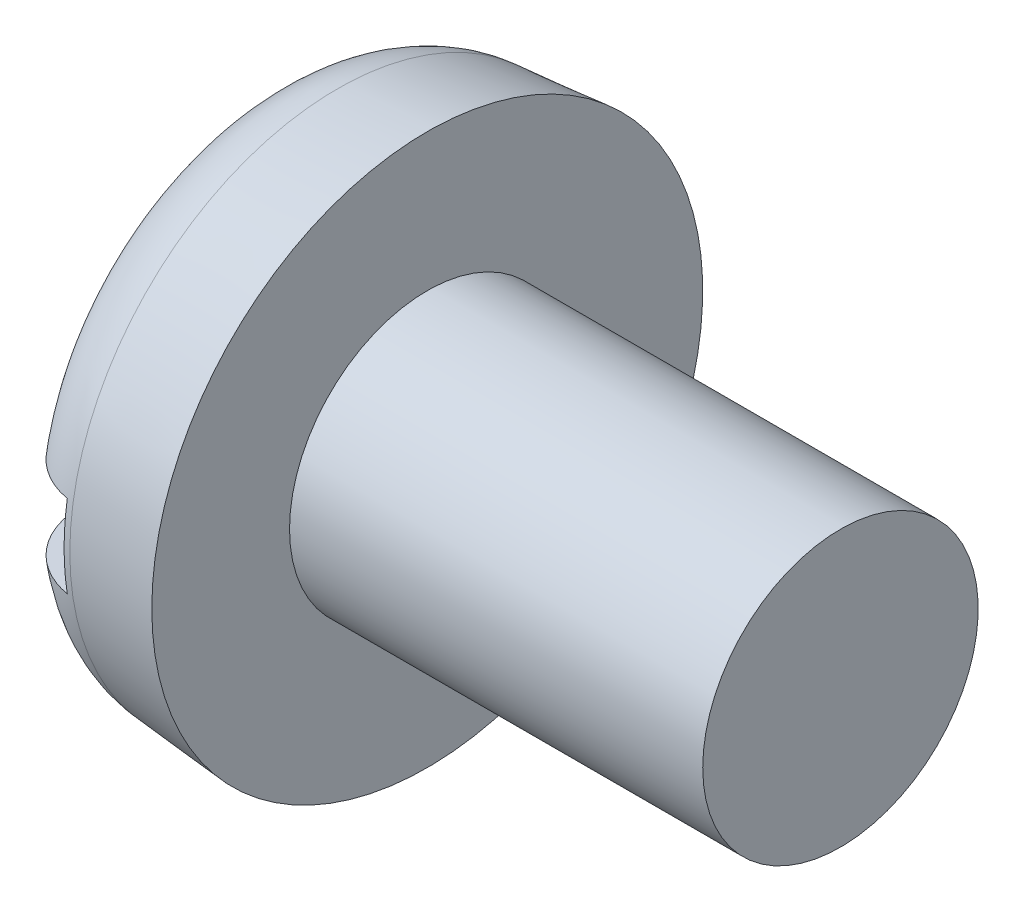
ISO-10303-21;
HEADER;
FILE_DESCRIPTION(('STEP AP214'),'2;1');
FILE_NAME('part.step','',(''),(''),'','','');
FILE_SCHEMA(('AUTOMOTIVE_DESIGN { 1 0 10303 214 1 1 1 1 }'));
ENDSEC;
DATA;
#1=APPLICATION_CONTEXT('core data for automotive mechanical design processes');
#2=APPLICATION_PROTOCOL_DEFINITION('international standard','automotive_design',2000,#1);
#3=PRODUCT_CONTEXT('',#1,'mechanical');
#4=PRODUCT('Part','Part','',(#3));
#5=PRODUCT_RELATED_PRODUCT_CATEGORY('part','',(#4));
#6=PRODUCT_DEFINITION_FORMATION('','',#4);
#7=PRODUCT_DEFINITION_CONTEXT('part definition',#1,'design');
#8=PRODUCT_DEFINITION('design','',#6,#7);
#9=PRODUCT_DEFINITION_SHAPE('','',#8);
#10=(LENGTH_UNIT() NAMED_UNIT(*) SI_UNIT(.MILLI.,.METRE.));
#11=(NAMED_UNIT(*) PLANE_ANGLE_UNIT() SI_UNIT($,.RADIAN.));
#12=(NAMED_UNIT(*) SI_UNIT($,.STERADIAN.) SOLID_ANGLE_UNIT());
#13=UNCERTAINTY_MEASURE_WITH_UNIT(LENGTH_MEASURE(1.E-05),#10,'distance_accuracy_value','');
#14=(GEOMETRIC_REPRESENTATION_CONTEXT(3) GLOBAL_UNCERTAINTY_ASSIGNED_CONTEXT((#13)) GLOBAL_UNIT_ASSIGNED_CONTEXT((#10,
#11,#12)) REPRESENTATION_CONTEXT('',''));
#15=CARTESIAN_POINT('',(0.,0.,0.));
#16=DIRECTION('',(0.,0.,1.));
#17=DIRECTION('',(1.,0.,0.));
#18=AXIS2_PLACEMENT_3D('',#15,#16,#17);
#19=CARTESIAN_POINT('',(0.,0.,0.));
#20=DIRECTION('',(-1.,0.,0.));
#21=DIRECTION('',(0.,0.,1.));
#22=AXIS2_PLACEMENT_3D('',#19,#20,#21);
#23=PLANE('',#22);
#24=DIRECTION('',(0.,0.,-1.));
#25=VECTOR('',#24,1.);
#26=CARTESIAN_POINT('',(0.,0.599999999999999,4.));
#27=LINE('',#26,#25);
#28=CARTESIAN_POINT('',(0.,0.599999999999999,2.62267277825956));
#29=VERTEX_POINT('',#28);
#30=CARTESIAN_POINT('',(0.,0.599999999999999,-2.62267277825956));
#31=VERTEX_POINT('',#30);
#32=EDGE_CURVE('E85',#29,#31,#27,.T.);
#33=ORIENTED_EDGE('',*,*,#32,.F.);
#34=CARTESIAN_POINT('',(0.,0.,0.));
#35=DIRECTION('',(-1.,0.,0.));
#36=DIRECTION('',(0.,0.,1.));
#37=AXIS2_PLACEMENT_3D('',#34,#35,#36);
#38=CIRCLE('',#37,2.69042979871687);
#39=EDGE_CURVE('E91',#29,#31,#38,.T.);
#40=ORIENTED_EDGE('',*,*,#39,.T.);
#41=EDGE_LOOP('',(#33,#40));
#42=FACE_BOUND('',#41,.T.);
#43=ADVANCED_FACE('F32',(#42),#23,.T.);
#44=CARTESIAN_POINT('',(-25.4,0.,0.));
#45=DIRECTION('',(-1.,0.,0.));
#46=DIRECTION('',(0.,0.,1.));
#47=AXIS2_PLACEMENT_3D('',#44,#45,#46);
#48=CYLINDRICAL_SURFACE('',#47,2.);
#49=CARTESIAN_POINT('',(8.4,0.,0.));
#50=DIRECTION('',(-1.,0.,0.));
#51=DIRECTION('',(0.,0.,1.));
#52=AXIS2_PLACEMENT_3D('',#49,#50,#51);
#53=CIRCLE('',#52,2.);
#54=CARTESIAN_POINT('',(8.4,0.,2.));
#55=VERTEX_POINT('',#54);
#56=EDGE_CURVE('E92',#55,#55,#53,.T.);
#57=ORIENTED_EDGE('',*,*,#56,.T.);
#58=EDGE_LOOP('',(#57));
#59=FACE_BOUND('',#58,.T.);
#60=CARTESIAN_POINT('',(2.4,0.,0.));
#61=DIRECTION('',(-1.,0.,0.));
#62=DIRECTION('',(0.,0.,1.));
#63=AXIS2_PLACEMENT_3D('',#60,#61,#62);
#64=CIRCLE('',#63,2.);
#65=CARTESIAN_POINT('',(2.4,0.,2.));
#66=VERTEX_POINT('',#65);
#67=EDGE_CURVE('E149',#66,#66,#64,.T.);
#68=ORIENTED_EDGE('',*,*,#67,.F.);
#69=EDGE_LOOP('',(#68));
#70=FACE_BOUND('',#69,.T.);
#71=ADVANCED_FACE('F137',(#59,#70),#48,.T.);
#72=CARTESIAN_POINT('',(8.4,2.,0.));
#73=DIRECTION('',(1.,0.,0.));
#74=DIRECTION('',(0.,0.,-1.));
#75=AXIS2_PLACEMENT_3D('',#72,#73,#74);
#76=PLANE('',#75);
#77=ORIENTED_EDGE('',*,*,#56,.F.);
#78=EDGE_LOOP('',(#77));
#79=FACE_BOUND('',#78,.T.);
#80=ADVANCED_FACE('F135',(#79),#76,.T.);
#81=DIRECTION('',(0.,0.,1.));
#82=VECTOR('',#81,1.);
#83=CARTESIAN_POINT('',(0.,-0.599999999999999,-4.));
#84=LINE('',#83,#82);
#85=CARTESIAN_POINT('',(0.,-0.6,-2.62267277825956));
#86=VERTEX_POINT('',#85);
#87=CARTESIAN_POINT('',(0.,-0.6,2.62267277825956));
#88=VERTEX_POINT('',#87);
#89=EDGE_CURVE('E76',#86,#88,#84,.T.);
#90=ORIENTED_EDGE('',*,*,#89,.F.);
#91=EDGE_CURVE('E83',#86,#88,#38,.T.);
#92=ORIENTED_EDGE('',*,*,#91,.T.);
#93=EDGE_LOOP('',(#90,#92));
#94=FACE_BOUND('',#93,.T.);
#95=ADVANCED_FACE('F82',(#94),#23,.T.);
#96=CARTESIAN_POINT('',(0.,0.,0.));
#97=DIRECTION('',(1.,0.,0.));
#98=DIRECTION('',(0.,0.,-1.));
#99=AXIS2_PLACEMENT_3D('',#96,#97,#98);
#100=CONICAL_SURFACE('',#99,3.79002720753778,0.0872664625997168);
#101=CARTESIAN_POINT('',(1.09541310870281,0.,0.));
#102=DIRECTION('',(-1.,0.,0.));
#103=DIRECTION('',(0.,0.,1.));
#104=AXIS2_PLACEMENT_3D('',#101,#102,#103);
#105=CIRCLE('',#104,3.88586343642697);
#106=CARTESIAN_POINT('',(1.09541310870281,0.,3.88586343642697));
#107=VERTEX_POINT('',#106);
#108=EDGE_CURVE('E95',#107,#107,#105,.F.);
#109=ORIENTED_EDGE('',*,*,#108,.T.);
#110=EDGE_LOOP('',(#109));
#111=FACE_BOUND('',#110,.T.);
#112=CARTESIAN_POINT('',(2.4,0.,0.));
#113=DIRECTION('',(-1.,0.,0.));
#114=DIRECTION('',(0.,0.,1.));
#115=AXIS2_PLACEMENT_3D('',#112,#113,#114);
#116=CIRCLE('',#115,4.);
#117=CARTESIAN_POINT('',(2.4,0.,4.));
#118=VERTEX_POINT('',#117);
#119=EDGE_CURVE('E97',#118,#118,#116,.T.);
#120=ORIENTED_EDGE('',*,*,#119,.T.);
#121=EDGE_LOOP('',(#120));
#122=FACE_BOUND('',#121,.T.);
#123=ADVANCED_FACE('F128',(#111,#122),#100,.T.);
#124=CARTESIAN_POINT('',(2.4,2.,0.));
#125=DIRECTION('',(-1.,0.,0.));
#126=DIRECTION('',(0.,0.,1.));
#127=AXIS2_PLACEMENT_3D('',#124,#125,#126);
#128=PLANE('',#127);
#129=ORIENTED_EDGE('',*,*,#119,.F.);
#130=EDGE_LOOP('',(#129));
#131=FACE_BOUND('',#130,.T.);
#132=ORIENTED_EDGE('',*,*,#67,.T.);
#133=EDGE_LOOP('',(#132));
#134=FACE_BOUND('',#133,.T.);
#135=ADVANCED_FACE('F124',(#131,#134),#128,.F.);
#136=CARTESIAN_POINT('',(1.2,0.,0.));
#137=DIRECTION('',(-1.,0.,0.));
#138=DIRECTION('',(0.,0.,1.));
#139=AXIS2_PLACEMENT_3D('',#136,#137,#138);
#140=TOROIDAL_SURFACE('',#139,2.69042979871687,1.2);
#141=CARTESIAN_POINT('',(0.3865043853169,0.599999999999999,-3.52185650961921));
#142=CARTESIAN_POINT('',(0.435468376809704,0.599999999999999,-3.56765543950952));
#143=CARTESIAN_POINT('',(0.48830443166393,0.599999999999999,-3.60938194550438));
#144=CARTESIAN_POINT('',(0.600265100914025,0.599999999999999,-3.68342203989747));
#145=CARTESIAN_POINT('',(0.659396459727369,0.599999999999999,-3.71572539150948));
#146=CARTESIAN_POINT('',(0.782252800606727,0.599999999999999,-3.76991557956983));
#147=CARTESIAN_POINT('',(0.845977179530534,0.599999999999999,-3.79180378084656));
#148=CARTESIAN_POINT('',(0.976191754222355,0.599999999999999,-3.82450279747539));
#149=CARTESIAN_POINT('',(1.04268130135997,0.599999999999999,-3.83531619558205));
#150=CARTESIAN_POINT('',(1.1761990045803,0.599999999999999,-3.84552483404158));
#151=CARTESIAN_POINT('',(1.2432228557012,0.599999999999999,-3.84497642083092));
#152=CARTESIAN_POINT('',(1.37622462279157,0.599999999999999,-3.83261582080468));
#153=CARTESIAN_POINT('',(1.44220252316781,0.599999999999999,-3.82080346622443));
#154=CARTESIAN_POINT('',(1.57113854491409,0.599999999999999,-3.7862937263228));
#155=CARTESIAN_POINT('',(1.63410108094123,0.599999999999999,-3.76361282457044));
#156=CARTESIAN_POINT('',(1.75534617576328,0.599999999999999,-3.70804459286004));
#157=CARTESIAN_POINT('',(1.81362870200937,0.599999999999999,-3.67515719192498));
#158=CARTESIAN_POINT('',(1.92413366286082,0.599999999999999,-3.5999836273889));
#159=CARTESIAN_POINT('',(1.97632984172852,0.599999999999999,-3.55765888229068));
#160=CARTESIAN_POINT('',(2.07296076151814,0.599999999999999,-3.46492588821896));
#161=CARTESIAN_POINT('',(2.11739523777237,0.599999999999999,-3.4145173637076));
#162=CARTESIAN_POINT('',(2.19773705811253,0.599999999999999,-3.30652404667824));
#163=CARTESIAN_POINT('',(2.2335546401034,0.599999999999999,-3.24887250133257));
#164=CARTESIAN_POINT('',(2.29517588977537,0.599999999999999,-3.12844912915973));
#165=CARTESIAN_POINT('',(2.32097889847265,0.599999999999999,-3.06567696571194));
#166=CARTESIAN_POINT('',(2.36230436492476,0.599999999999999,-2.93572304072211));
#167=CARTESIAN_POINT('',(2.37765465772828,0.599999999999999,-2.86848656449));
#168=CARTESIAN_POINT('',(2.39710654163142,0.599999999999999,-2.73240889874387));
#169=CARTESIAN_POINT('',(2.40120699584,0.599999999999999,-2.66356754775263));
#170=CARTESIAN_POINT('',(2.39814758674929,0.599999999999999,-2.52464946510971));
#171=CARTESIAN_POINT('',(2.39074269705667,0.599999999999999,-2.45457815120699));
#172=CARTESIAN_POINT('',(2.36454808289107,0.599999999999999,-2.31659764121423));
#173=CARTESIAN_POINT('',(2.34575688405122,0.599999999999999,-2.24868872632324));
#174=CARTESIAN_POINT('',(2.29682890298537,0.599999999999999,-2.11531585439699));
#175=CARTESIAN_POINT('',(2.26644200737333,0.599999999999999,-2.04994358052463));
#176=CARTESIAN_POINT('',(2.19524076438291,0.599999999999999,-1.92513363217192));
#177=CARTESIAN_POINT('',(2.15442449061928,0.599999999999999,-1.86569705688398));
#178=CARTESIAN_POINT('',(2.06294283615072,0.599999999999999,-1.75389115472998));
#179=CARTESIAN_POINT('',(2.01217853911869,0.599999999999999,-1.70160258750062));
#180=CARTESIAN_POINT('',(1.90235992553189,0.599999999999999,-1.60657192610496));
#181=CARTESIAN_POINT('',(1.84330597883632,0.599999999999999,-1.56382940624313));
#182=CARTESIAN_POINT('',(1.72028944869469,0.599999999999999,-1.49071034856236));
#183=CARTESIAN_POINT('',(1.65652070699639,0.599999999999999,-1.46000898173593));
#184=CARTESIAN_POINT('',(1.52445964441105,0.599999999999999,-1.41076217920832));
#185=CARTESIAN_POINT('',(1.45617085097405,0.599999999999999,-1.39220738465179));
#186=CARTESIAN_POINT('',(1.32258878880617,0.599999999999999,-1.3692588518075));
#187=CARTESIAN_POINT('',(1.25746124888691,0.599999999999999,-1.36389765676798));
#188=CARTESIAN_POINT('',(1.12729576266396,0.599999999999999,-1.36480396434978));
#189=CARTESIAN_POINT('',(1.06225779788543,0.599999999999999,-1.37106853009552));
#190=CARTESIAN_POINT('',(0.937361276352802,0.599999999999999,-1.39427975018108));
#191=CARTESIAN_POINT('',(0.877403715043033,0.599999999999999,-1.41070181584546));
#192=CARTESIAN_POINT('',(0.760914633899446,0.599999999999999,-1.45296891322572));
#193=CARTESIAN_POINT('',(0.704383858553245,0.599999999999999,-1.47881598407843));
#194=CARTESIAN_POINT('',(0.59370506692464,0.599999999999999,-1.54020998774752));
#195=CARTESIAN_POINT('',(0.539760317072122,0.599999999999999,-1.57612236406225));
#196=CARTESIAN_POINT('',(0.438104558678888,0.599999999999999,-1.65588570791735));
#197=CARTESIAN_POINT('',(0.390395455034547,0.599999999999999,-1.69973909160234));
#198=CARTESIAN_POINT('',(0.298820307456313,0.599999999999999,-1.79776253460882));
#199=CARTESIAN_POINT('',(0.255521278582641,0.599999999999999,-1.85246315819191));
#200=CARTESIAN_POINT('',(0.178283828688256,0.599999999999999,-1.96812037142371));
#201=CARTESIAN_POINT('',(0.144347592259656,0.599999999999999,-2.02907841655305));
#202=CARTESIAN_POINT('',(0.0855336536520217,0.599999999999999,-2.15824220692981));
#203=CARTESIAN_POINT('',(0.0610804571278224,0.599999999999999,-2.22664188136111));
#204=CARTESIAN_POINT('',(0.0240295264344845,0.599999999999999,-2.36658228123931));
#205=CARTESIAN_POINT('',(0.0114315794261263,0.599999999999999,-2.43812295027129));
#206=CARTESIAN_POINT('',(-0.00140349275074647,0.599999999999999,-2.58214276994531));
#207=CARTESIAN_POINT('',(-0.00166960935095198,0.599999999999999,-2.65461931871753));
#208=CARTESIAN_POINT('',(0.0102529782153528,0.599999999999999,-2.79856484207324));
#209=CARTESIAN_POINT('',(0.0224436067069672,0.599999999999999,-2.87003365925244));
#210=CARTESIAN_POINT('',(0.0586721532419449,0.599999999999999,-3.00828260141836));
#211=CARTESIAN_POINT('',(0.082454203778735,0.599999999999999,-3.07512990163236));
#212=CARTESIAN_POINT('',(0.141152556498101,0.599999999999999,-3.20367573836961));
#213=CARTESIAN_POINT('',(0.176053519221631,0.599999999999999,-3.26538122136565));
#214=CARTESIAN_POINT('',(0.240740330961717,0.599999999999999,-3.35956174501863));
#215=CARTESIAN_POINT('',(0.267410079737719,0.599999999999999,-3.39421743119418));
#216=CARTESIAN_POINT('',(0.324340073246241,0.599999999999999,-3.46044388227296));
#217=CARTESIAN_POINT('',(0.354600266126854,0.599999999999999,-3.49201469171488));
#218=CARTESIAN_POINT('',(0.3865043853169,0.599999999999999,-3.52185650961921));
#219=B_SPLINE_CURVE_WITH_KNOTS('',3,(#141,#142,#143,#144,#145,#146,#147,#148,#149,#150,#151,
#152,#153,#154,#155,#156,#157,#158,#159,#160,#161,#162,#163,#164,#165,#166,#167,#168,#169,#170,
#171,#172,#173,#174,#175,#176,#177,#178,#179,#180,#181,#182,#183,#184,#185,#186,#187,#188,#189,
#190,#191,#192,#193,#194,#195,#196,#197,#198,#199,#200,#201,#202,#203,#204,#205,#206,#207,#208,
#209,#210,#211,#212,#213,#214,#215,#216,#217,#218),.UNSPECIFIED.,.T.,.F.,(4,2,2,2,2,2,2,2,2,2,2,
2,2,2,2,2,2,2,2,2,2,2,2,2,2,2,2,2,2,2,2,2,2,2,2,2,2,2,4),(0.,0.200976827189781,
0.402171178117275,0.603339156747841,0.804460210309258,1.0045840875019,1.2047109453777,
1.40453524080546,1.60436092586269,1.80501901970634,2.00568395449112,2.2083565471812,
2.41104247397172,2.61699090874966,2.82296015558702,3.03337636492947,3.24381982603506,
3.45908552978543,3.67439102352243,3.8919572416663,4.10951375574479,4.32071351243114,
4.53175034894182,4.72677835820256,4.92175710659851,5.10742155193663,5.29312619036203,
5.48672044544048,5.68037370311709,5.88873369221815,6.09714225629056,6.31402614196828,
6.53090613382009,6.74727622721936,6.96367975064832,7.17550906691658,7.38704740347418,
7.51800243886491,7.64895558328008),.UNSPECIFIED.);
#220=CARTESIAN_POINT('',(1.,0.599999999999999,-3.8268957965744));
#221=VERTEX_POINT('',#220);
#222=EDGE_CURVE('E11',#31,#221,#219,.T.);
#223=ORIENTED_EDGE('',*,*,#222,.F.);
#224=ORIENTED_EDGE('',*,*,#39,.F.);
#225=CARTESIAN_POINT('',(0.568676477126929,0.599999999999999,1.55841219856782));
#226=CARTESIAN_POINT('',(0.622454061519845,0.599999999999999,1.52276443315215));
#227=CARTESIAN_POINT('',(0.679085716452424,0.599999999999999,1.49137245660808));
#228=CARTESIAN_POINT('',(0.796770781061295,0.599999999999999,1.43831139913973));
#229=CARTESIAN_POINT('',(0.857825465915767,0.599999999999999,1.41664513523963));
#230=CARTESIAN_POINT('',(0.982921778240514,0.599999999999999,1.38402811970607));
#231=CARTESIAN_POINT('',(1.04697051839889,0.599999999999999,1.37310440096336));
#232=CARTESIAN_POINT('',(1.17597937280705,0.599999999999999,1.36268675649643));
#233=CARTESIAN_POINT('',(1.24093916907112,0.599999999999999,1.36318893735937));
#234=CARTESIAN_POINT('',(1.36722529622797,0.599999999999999,1.37533615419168));
#235=CARTESIAN_POINT('',(1.42859438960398,0.599999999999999,1.38654477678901));
#236=CARTESIAN_POINT('',(1.54865022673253,0.599999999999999,1.41889802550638));
#237=CARTESIAN_POINT('',(1.60733638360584,0.599999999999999,1.44004481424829));
#238=CARTESIAN_POINT('',(1.72180457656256,0.599999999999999,1.49189888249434));
#239=CARTESIAN_POINT('',(1.77749881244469,0.599999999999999,1.52279911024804));
#240=CARTESIAN_POINT('',(1.88340638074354,0.599999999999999,1.59287167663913));
#241=CARTESIAN_POINT('',(1.93361816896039,0.599999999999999,1.63204633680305));
#242=CARTESIAN_POINT('',(2.03113053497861,0.599999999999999,1.7207614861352));
#243=CARTESIAN_POINT('',(2.07792119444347,0.599999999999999,1.77086293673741));
#244=CARTESIAN_POINT('',(2.16295007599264,0.599999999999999,1.87786529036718));
#245=CARTESIAN_POINT('',(2.20118595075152,0.599999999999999,1.93476805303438));
#246=CARTESIAN_POINT('',(2.26997158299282,0.599999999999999,2.05705672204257));
#247=CARTESIAN_POINT('',(2.30000838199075,0.599999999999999,2.12273201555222));
#248=CARTESIAN_POINT('',(2.34872218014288,0.599999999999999,2.25817360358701));
#249=CARTESIAN_POINT('',(2.36739836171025,0.599999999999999,2.32794019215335));
#250=CARTESIAN_POINT('',(2.39284815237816,0.599999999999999,2.47012141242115));
#251=CARTESIAN_POINT('',(2.3995382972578,0.599999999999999,2.54255105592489));
#252=CARTESIAN_POINT('',(2.40041533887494,0.599999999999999,2.68749005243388));
#253=CARTESIAN_POINT('',(2.39460324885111,0.599999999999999,2.75999939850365));
#254=CARTESIAN_POINT('',(2.37072428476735,0.599999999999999,2.90156578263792));
#255=CARTESIAN_POINT('',(2.35289092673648,0.599999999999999,2.97066215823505));
#256=CARTESIAN_POINT('',(2.3055955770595,0.599999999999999,3.10475609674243));
#257=CARTESIAN_POINT('',(2.2761350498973,0.599999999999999,3.16975417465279));
#258=CARTESIAN_POINT('',(2.20718370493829,0.599999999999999,3.29217559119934));
#259=CARTESIAN_POINT('',(2.16794580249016,0.599999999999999,3.34974141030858));
#260=CARTESIAN_POINT('',(2.08018656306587,0.599999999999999,3.45730019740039));
#261=CARTESIAN_POINT('',(2.03166624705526,0.599999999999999,3.50729399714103));
#262=CARTESIAN_POINT('',(1.92773605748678,0.599999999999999,3.59728886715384));
#263=CARTESIAN_POINT('',(1.87247613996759,0.599999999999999,3.63746317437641));
#264=CARTESIAN_POINT('',(1.75592540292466,0.599999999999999,3.70782235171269));
#265=CARTESIAN_POINT('',(1.69463504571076,0.599999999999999,3.73800798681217));
#266=CARTESIAN_POINT('',(1.5686108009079,0.599999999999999,3.78714975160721));
#267=CARTESIAN_POINT('',(1.50393088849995,0.599999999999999,3.80624437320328));
#268=CARTESIAN_POINT('',(1.37227430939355,0.599999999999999,3.83322369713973));
#269=CARTESIAN_POINT('',(1.30529774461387,0.599999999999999,3.84110889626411));
#270=CARTESIAN_POINT('',(1.17141837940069,0.599999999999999,3.845417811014));
#271=CARTESIAN_POINT('',(1.10451797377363,0.599999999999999,3.841916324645));
#272=CARTESIAN_POINT('',(0.972258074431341,0.599999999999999,3.82372114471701));
#273=CARTESIAN_POINT('',(0.906898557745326,0.599999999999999,3.80902761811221));
#274=CARTESIAN_POINT('',(0.779620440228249,0.599999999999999,3.76890152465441));
#275=CARTESIAN_POINT('',(0.717699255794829,0.599999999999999,3.74347714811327));
#276=CARTESIAN_POINT('',(0.598976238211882,0.599999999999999,3.68264222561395));
#277=CARTESIAN_POINT('',(0.542174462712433,0.599999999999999,3.64723156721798));
#278=CARTESIAN_POINT('',(0.434989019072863,0.599999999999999,3.56726339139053));
#279=CARTESIAN_POINT('',(0.384638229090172,0.599999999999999,3.5226618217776));
#280=CARTESIAN_POINT('',(0.292043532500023,0.599999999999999,3.42571932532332));
#281=CARTESIAN_POINT('',(0.249799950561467,0.599999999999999,3.37337808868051));
#282=CARTESIAN_POINT('',(0.174110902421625,0.599999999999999,3.26185326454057));
#283=CARTESIAN_POINT('',(0.140765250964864,0.599999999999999,3.20260196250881));
#284=CARTESIAN_POINT('',(0.0843091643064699,0.599999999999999,3.07941230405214));
#285=CARTESIAN_POINT('',(0.0611994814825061,0.599999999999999,3.01547360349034));
#286=CARTESIAN_POINT('',(0.0254327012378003,0.599999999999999,2.88357716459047));
#287=CARTESIAN_POINT('',(0.0129588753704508,0.599999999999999,2.81556976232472));
#288=CARTESIAN_POINT('',(-0.000658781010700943,0.599999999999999,2.67843562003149));
#289=CARTESIAN_POINT('',(-0.00180186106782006,0.599999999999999,2.60930880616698));
#290=CARTESIAN_POINT('',(0.00723867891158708,0.599999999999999,2.47027110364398));
#291=CARTESIAN_POINT('',(0.0176724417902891,0.599999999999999,2.40037650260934));
#292=CARTESIAN_POINT('',(0.0498636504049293,0.599999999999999,2.2632278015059));
#293=CARTESIAN_POINT('',(0.0716251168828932,0.599999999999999,2.19597464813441));
#294=CARTESIAN_POINT('',(0.126425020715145,0.599999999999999,2.06442921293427));
#295=CARTESIAN_POINT('',(0.159709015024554,0.599999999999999,2.00023925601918));
#296=CARTESIAN_POINT('',(0.236484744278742,0.599999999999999,1.87833288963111));
#297=CARTESIAN_POINT('',(0.279968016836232,0.599999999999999,1.82061117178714));
#298=CARTESIAN_POINT('',(0.363480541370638,0.599999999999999,1.7273106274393));
#299=CARTESIAN_POINT('',(0.401461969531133,0.599999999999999,1.68987927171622));
#300=CARTESIAN_POINT('',(0.481873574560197,0.599999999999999,1.62013708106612));
#301=CARTESIAN_POINT('',(0.524303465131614,0.599999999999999,1.58782591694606));
#302=CARTESIAN_POINT('',(0.568676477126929,0.599999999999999,1.55841219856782));
#303=B_SPLINE_CURVE_WITH_KNOTS('',3,(#225,#226,#227,#228,#229,#230,#231,#232,#233,#234,#235,
#236,#237,#238,#239,#240,#241,#242,#243,#244,#245,#246,#247,#248,#249,#250,#251,#252,#253,#254,
#255,#256,#257,#258,#259,#260,#261,#262,#263,#264,#265,#266,#267,#268,#269,#270,#271,#272,#273,
#274,#275,#276,#277,#278,#279,#280,#281,#282,#283,#284,#285,#286,#287,#288,#289,#290,#291,#292,
#293,#294,#295,#296,#297,#298,#299,#300,#301,#302),.UNSPECIFIED.,.T.,.F.,(4,2,2,2,2,2,2,2,2,2,2,
2,2,2,2,2,2,2,2,2,2,2,2,2,2,2,2,2,2,2,2,2,2,2,2,2,2,2,4),(0.,0.193385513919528,
0.386827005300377,0.580754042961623,0.774615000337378,0.960896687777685,1.14721893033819,
1.33748625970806,1.52780704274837,1.73256769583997,1.93738446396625,2.15302491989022,
2.3686808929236,2.58583282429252,2.80296715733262,3.01600070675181,3.22900743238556,
3.43699107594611,3.64495185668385,3.84892478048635,4.05288207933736,4.25423457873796,
4.45557815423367,4.65560180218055,4.85562246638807,5.05549074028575,5.25536126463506,
5.45621303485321,5.6570728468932,5.86009921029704,6.06314049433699,6.26961358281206,
6.47610034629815,6.68713711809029,6.89824884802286,7.11416888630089,7.3299104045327,
7.4894871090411,7.64905354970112),.UNSPECIFIED.);
#304=CARTESIAN_POINT('',(1.,0.599999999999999,3.8268957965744));
#305=VERTEX_POINT('',#304);
#306=EDGE_CURVE('E109',#305,#29,#303,.T.);
#307=ORIENTED_EDGE('',*,*,#306,.F.);
#308=CARTESIAN_POINT('',(1.,0.,0.));
#309=DIRECTION('',(-1.,0.,0.));
#310=DIRECTION('',(0.,0.,1.));
#311=AXIS2_PLACEMENT_3D('',#308,#309,#310);
#312=CIRCLE('',#311,3.8736457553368);
#313=CARTESIAN_POINT('',(1.,-0.600000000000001,3.8268957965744));
#314=VERTEX_POINT('',#313);
#315=EDGE_CURVE('E103',#305,#314,#312,.F.);
#316=ORIENTED_EDGE('',*,*,#315,.T.);
#317=CARTESIAN_POINT('',(0.568676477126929,-0.6,1.55841219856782));
#318=CARTESIAN_POINT('',(0.509332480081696,-0.6,1.59775463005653));
#319=CARTESIAN_POINT('',(0.453379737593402,-0.6,1.64234041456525));
#320=CARTESIAN_POINT('',(0.349719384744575,-0.6,1.74035526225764));
#321=CARTESIAN_POINT('',(0.302029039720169,-0.6,1.79380239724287));
#322=CARTESIAN_POINT('',(0.216237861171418,-0.6,1.90774469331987));
#323=CARTESIAN_POINT('',(0.178118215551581,-0.6,1.96822568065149));
#324=CARTESIAN_POINT('',(0.112363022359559,-0.6,2.0946004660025));
#325=CARTESIAN_POINT('',(0.0847225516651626,-0.6,2.16049170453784));
#326=CARTESIAN_POINT('',(0.0402688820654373,-0.6,2.29725613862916));
#327=CARTESIAN_POINT('',(0.0236758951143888,-0.6,2.36820113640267));
#328=CARTESIAN_POINT('',(0.00278349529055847,-0.6,2.51189141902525));
#329=CARTESIAN_POINT('',(-0.00151505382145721,-0.6,2.58463683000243));
#330=CARTESIAN_POINT('',(0.00243750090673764,-0.6,2.72894600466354));
#331=CARTESIAN_POINT('',(0.010543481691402,-0.6,2.80051368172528));
#332=CARTESIAN_POINT('',(0.0389520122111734,-0.6,2.94118836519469));
#333=CARTESIAN_POINT('',(0.0592529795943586,-0.6,3.01029568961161));
#334=CARTESIAN_POINT('',(0.110960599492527,-0.6,3.1423581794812));
#335=CARTESIAN_POINT('',(0.142096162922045,-0.6,3.20541948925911));
#336=CARTESIAN_POINT('',(0.214736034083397,-0.6,3.32525905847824));
#337=CARTESIAN_POINT('',(0.256239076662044,-0.6,3.38203808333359));
#338=CARTESIAN_POINT('',(0.347460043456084,-0.6,3.48641848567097));
#339=CARTESIAN_POINT('',(0.396982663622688,-0.6,3.53419059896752));
#340=CARTESIAN_POINT('',(0.503454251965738,-0.6,3.62058393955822));
#341=CARTESIAN_POINT('',(0.560402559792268,-0.600000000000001,3.6592059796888));
#342=CARTESIAN_POINT('',(0.67915616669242,-0.600000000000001,3.72559524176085));
#343=CARTESIAN_POINT('',(0.740873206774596,-0.600000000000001,3.75352040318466));
#344=CARTESIAN_POINT('',(0.868147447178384,-0.600000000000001,3.79850563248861));
#345=CARTESIAN_POINT('',(0.933704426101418,-0.600000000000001,3.81556632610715));
#346=CARTESIAN_POINT('',(1.06616217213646,-0.600000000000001,3.83820251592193));
#347=CARTESIAN_POINT('',(1.13304550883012,-0.600000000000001,3.84388011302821));
#348=CARTESIAN_POINT('',(1.26681198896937,-0.600000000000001,3.84388783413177));
#349=CARTESIAN_POINT('',(1.33369513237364,-0.600000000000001,3.83821825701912));
#350=CARTESIAN_POINT('',(1.46534857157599,-0.600000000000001,3.81573676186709));
#351=CARTESIAN_POINT('',(1.5301247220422,-0.600000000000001,3.79895909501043));
#352=CARTESIAN_POINT('',(1.65595122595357,-0.600000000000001,3.75479405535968));
#353=CARTESIAN_POINT('',(1.7170015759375,-0.600000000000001,3.72740667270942));
#354=CARTESIAN_POINT('',(1.83382644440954,-0.600000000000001,3.66274505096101));
#355=CARTESIAN_POINT('',(1.88958679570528,-0.6,3.62544522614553));
#356=CARTESIAN_POINT('',(1.99411858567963,-0.6,3.54208564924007));
#357=CARTESIAN_POINT('',(2.04288982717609,-0.6,3.49602565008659));
#358=CARTESIAN_POINT('',(2.1325144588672,-0.6,3.39605796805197));
#359=CARTESIAN_POINT('',(2.17329813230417,-0.6,3.34208780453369));
#360=CARTESIAN_POINT('',(2.245373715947,-0.6,3.22814724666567));
#361=CARTESIAN_POINT('',(2.27666509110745,-0.6,3.16817651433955));
#362=CARTESIAN_POINT('',(2.32937247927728,-0.6,3.04302336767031));
#363=CARTESIAN_POINT('',(2.35063955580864,-0.6,2.97777826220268));
#364=CARTESIAN_POINT('',(2.3821555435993,-0.6,2.84468257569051));
#365=CARTESIAN_POINT('',(2.39240345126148,-0.6,2.77683175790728));
#366=CARTESIAN_POINT('',(2.40182781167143,-0.6,2.6389851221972));
#367=CARTESIAN_POINT('',(2.40077563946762,-0.6,2.56897370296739));
#368=CARTESIAN_POINT('',(2.38721389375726,-0.6,2.43007140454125));
#369=CARTESIAN_POINT('',(2.37470291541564,-0.6,2.36118066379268));
#370=CARTESIAN_POINT('',(2.33824897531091,-0.6,2.22476443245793));
#371=CARTESIAN_POINT('',(2.31404566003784,-0.6,2.15730848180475));
#372=CARTESIAN_POINT('',(2.25484108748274,-0.6,2.02730649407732));
#373=CARTESIAN_POINT('',(2.21983804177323,-0.6,1.96476127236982));
#374=CARTESIAN_POINT('',(2.13932874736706,-0.6,1.8453529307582));
#375=CARTESIAN_POINT('',(2.09366234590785,-0.6,1.78859760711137));
#376=CARTESIAN_POINT('',(1.99331431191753,-0.6,1.68367587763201));
#377=CARTESIAN_POINT('',(1.93863170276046,-0.6,1.63551040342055));
#378=CARTESIAN_POINT('',(1.82254625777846,-0.6,1.55016942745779));
#379=CARTESIAN_POINT('',(1.7612597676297,-0.6,1.51283623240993));
#380=CARTESIAN_POINT('',(1.6329601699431,-0.6,1.44984263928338));
#381=CARTESIAN_POINT('',(1.56595104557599,-0.6,1.42417419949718));
#382=CARTESIAN_POINT('',(1.43290073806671,-0.6,1.38720166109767));
#383=CARTESIAN_POINT('',(1.36709528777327,-0.6,1.37505067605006));
#384=CARTESIAN_POINT('',(1.23436273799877,-0.6,1.3628486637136));
#385=CARTESIAN_POINT('',(1.16743586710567,-0.6,1.36279519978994));
#386=CARTESIAN_POINT('',(1.03904581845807,-0.6,1.37438428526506));
#387=CARTESIAN_POINT('',(0.97751125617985,-0.6,1.38526326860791));
#388=CARTESIAN_POINT('',(0.857136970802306,-0.6,1.41700902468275));
#389=CARTESIAN_POINT('',(0.79829431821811,-0.6,1.43786464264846));
#390=CARTESIAN_POINT('',(0.711456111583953,-0.6,1.47666141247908));
#391=CARTESIAN_POINT('',(0.681965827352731,-0.6,1.49136190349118));
#392=CARTESIAN_POINT('',(0.624300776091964,-0.6,1.52313858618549));
#393=CARTESIAN_POINT('',(0.596125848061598,-0.6,1.54021448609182));
#394=CARTESIAN_POINT('',(0.568676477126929,-0.6,1.55841219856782));
#395=B_SPLINE_CURVE_WITH_KNOTS('',3,(#317,#318,#319,#320,#321,#322,#323,#324,#325,#326,#327,
#328,#329,#330,#331,#332,#333,#334,#335,#336,#337,#338,#339,#340,#341,#342,#343,#344,#345,#346,
#347,#348,#349,#350,#351,#352,#353,#354,#355,#356,#357,#358,#359,#360,#361,#362,#363,#364,#365,
#366,#367,#368,#369,#370,#371,#372,#373,#374,#375,#376,#377,#378,#379,#380,#381,#382,#383,#384,
#385,#386,#387,#388,#389,#390,#391,#392,#393,#394),.UNSPECIFIED.,.T.,.F.,(4,2,2,2,2,2,2,2,2,2,2,
2,2,2,2,2,2,2,2,2,2,2,2,2,2,2,2,2,2,2,2,2,2,2,2,2,2,2,4),(0.,0.2134759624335,0.427392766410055,
0.640885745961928,0.854278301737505,1.07180637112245,1.28934972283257,1.50436737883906,
1.71935714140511,1.92931435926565,2.13924596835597,2.34467456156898,2.55008489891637,
2.75233330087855,2.95457005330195,3.15498457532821,3.355393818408,3.55518797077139,
3.75498230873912,3.95529744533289,4.15561823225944,4.35761633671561,4.55962582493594,
4.76454879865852,4.96949043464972,5.17858616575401,5.38770753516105,5.60171647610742,
5.815760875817,6.03325422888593,6.25077115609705,6.46494128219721,6.67896353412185,
6.87865214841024,7.07830054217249,7.26491113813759,7.4513135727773,7.55006829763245,
7.64881090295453),.UNSPECIFIED.);
#396=EDGE_CURVE('E90',#88,#314,#395,.T.);
#397=ORIENTED_EDGE('',*,*,#396,.F.);
#398=ORIENTED_EDGE('',*,*,#91,.F.);
#399=CARTESIAN_POINT('',(0.3865043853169,-0.6,-3.52185650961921));
#400=CARTESIAN_POINT('',(0.336558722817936,-0.6,-3.47513075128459));
#401=CARTESIAN_POINT('',(0.290567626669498,-0.6,-3.42409544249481));
#402=CARTESIAN_POINT('',(0.207816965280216,-0.6,-3.31495007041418));
#403=CARTESIAN_POINT('',(0.171070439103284,-0.6,-3.2568301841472));
#404=CARTESIAN_POINT('',(0.107859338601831,-0.6,-3.13533662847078));
#405=CARTESIAN_POINT('',(0.081381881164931,-0.6,-3.07196966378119));
#406=CARTESIAN_POINT('',(0.0392838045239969,-0.6,-2.94175448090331));
#407=CARTESIAN_POINT('',(0.0236604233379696,-0.6,-2.87490715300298));
#408=CARTESIAN_POINT('',(0.00341113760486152,-0.6,-2.73858284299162));
#409=CARTESIAN_POINT('',(-0.00105268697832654,-0.6,-2.66908182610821));
#410=CARTESIAN_POINT('',(0.00147102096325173,-0.6,-2.53028718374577));
#411=CARTESIAN_POINT('',(0.00846038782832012,-0.6,-2.46099359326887));
#412=CARTESIAN_POINT('',(0.0338721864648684,-0.6,-2.3228723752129));
#413=CARTESIAN_POINT('',(0.052556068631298,-0.6,-2.25409284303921));
#414=CARTESIAN_POINT('',(0.100979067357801,-0.6,-2.12053875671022));
#415=CARTESIAN_POINT('',(0.13071979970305,-0.6,-2.05576478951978));
#416=CARTESIAN_POINT('',(0.201105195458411,-0.6,-1.93075930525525));
#417=CARTESIAN_POINT('',(0.241951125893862,-0.6,-1.87064095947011));
#418=CARTESIAN_POINT('',(0.333200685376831,-0.6,-1.75812796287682));
#419=CARTESIAN_POINT('',(0.383605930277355,-0.6,-1.70573462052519));
#420=CARTESIAN_POINT('',(0.49243046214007,-0.6,-1.61063718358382));
#421=CARTESIAN_POINT('',(0.550808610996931,-0.6,-1.5678861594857));
#422=CARTESIAN_POINT('',(0.674249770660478,-0.6,-1.49345451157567));
#423=CARTESIAN_POINT('',(0.739309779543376,-0.6,-1.46176894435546));
#424=CARTESIAN_POINT('',(0.870462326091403,-0.6,-1.41247032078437));
#425=CARTESIAN_POINT('',(0.936297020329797,-0.6,-1.39417366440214));
#426=CARTESIAN_POINT('',(1.0701878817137,-0.6,-1.36992148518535));
#427=CARTESIAN_POINT('',(1.13824253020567,-0.6,-1.36395769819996));
#428=CARTESIAN_POINT('',(1.26912997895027,-0.6,-1.36469761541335));
#429=CARTESIAN_POINT('',(1.33196990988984,-0.6,-1.37048080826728));
#430=CARTESIAN_POINT('',(1.45576558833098,-0.6,-1.39257493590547));
#431=CARTESIAN_POINT('',(1.51672119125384,-0.6,-1.40888667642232));
#432=CARTESIAN_POINT('',(1.63489640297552,-0.6,-1.45115860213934));
#433=CARTESIAN_POINT('',(1.6921296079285,-0.6,-1.47708105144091));
#434=CARTESIAN_POINT('',(1.80183592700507,-0.6,-1.53754737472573));
#435=CARTESIAN_POINT('',(1.85430778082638,-0.6,-1.57209352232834));
#436=CARTESIAN_POINT('',(1.95690912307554,-0.6,-1.65139148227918));
#437=CARTESIAN_POINT('',(2.00661704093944,-0.6,-1.69668868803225));
#438=CARTESIAN_POINT('',(2.09829662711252,-0.6,-1.79453297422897));
#439=CARTESIAN_POINT('',(2.14026595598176,-0.6,-1.84708223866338));
#440=CARTESIAN_POINT('',(2.21793843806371,-0.6,-1.96160125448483));
#441=CARTESIAN_POINT('',(2.25307298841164,-0.6,-2.02395766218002));
#442=CARTESIAN_POINT('',(2.31259182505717,-0.6,-2.15361082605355));
#443=CARTESIAN_POINT('',(2.33697474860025,-0.6,-2.22090820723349));
#444=CARTESIAN_POINT('',(2.37457912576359,-0.6,-2.35984116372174));
#445=CARTESIAN_POINT('',(2.38759592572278,-0.6,-2.43153235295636));
#446=CARTESIAN_POINT('',(2.40121636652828,-0.6,-2.57608878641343));
#447=CARTESIAN_POINT('',(2.40182066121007,-0.6,-2.64895396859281));
#448=CARTESIAN_POINT('',(2.39052951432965,-0.6,-2.79263451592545));
#449=CARTESIAN_POINT('',(2.37881794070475,-0.6,-2.86346426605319));
#450=CARTESIAN_POINT('',(2.34337531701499,-0.6,-3.00205279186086));
#451=CARTESIAN_POINT('',(2.31964575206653,-0.6,-3.06981194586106));
#452=CARTESIAN_POINT('',(2.26145401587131,-0.6,-3.19862221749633));
#453=CARTESIAN_POINT('',(2.22725936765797,-0.6,-3.25979420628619));
#454=CARTESIAN_POINT('',(2.14887906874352,-0.6,-3.375364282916));
#455=CARTESIAN_POINT('',(2.10469456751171,-0.6,-3.42976314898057));
#456=CARTESIAN_POINT('',(2.00858874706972,-0.6,-3.52906182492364));
#457=CARTESIAN_POINT('',(1.95684621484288,-0.599999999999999,-3.57413473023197));
#458=CARTESIAN_POINT('',(1.84643427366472,-0.599999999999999,-3.65480066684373));
#459=CARTESIAN_POINT('',(1.78776544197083,-0.599999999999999,-3.6903944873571));
#460=CARTESIAN_POINT('',(1.66608419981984,-0.599999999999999,-3.75057174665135));
#461=CARTESIAN_POINT('',(1.60314657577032,-0.599999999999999,-3.77530647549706));
#462=CARTESIAN_POINT('',(1.47399447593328,-0.599999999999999,-3.81375981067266));
#463=CARTESIAN_POINT('',(1.40778030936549,-0.599999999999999,-3.82747945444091));
#464=CARTESIAN_POINT('',(1.27453622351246,-0.599999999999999,-3.84342379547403));
#465=CARTESIAN_POINT('',(1.20751747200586,-0.599999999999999,-3.8457419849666));
#466=CARTESIAN_POINT('',(1.07402733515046,-0.599999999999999,-3.83906549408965));
#467=CARTESIAN_POINT('',(1.00755608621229,-0.599999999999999,-3.83006807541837));
#468=CARTESIAN_POINT('',(0.877192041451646,-0.599999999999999,-3.80105552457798));
#469=CARTESIAN_POINT('',(0.813295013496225,-0.599999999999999,-3.78105934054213));
#470=CARTESIAN_POINT('',(0.68980965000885,-0.599999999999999,-3.73066689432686));
#471=CARTESIAN_POINT('',(0.630215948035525,-0.599999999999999,-3.7002838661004));
#472=CARTESIAN_POINT('',(0.540159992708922,-0.599999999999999,-3.64444320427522));
#473=CARTESIAN_POINT('',(0.507753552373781,-0.6,-3.62205529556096));
#474=CARTESIAN_POINT('',(0.445296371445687,-0.6,-3.57420610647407));
#475=CARTESIAN_POINT('',(0.415245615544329,-0.6,-3.54874484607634));
#476=CARTESIAN_POINT('',(0.3865043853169,-0.6,-3.52185650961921));
#477=B_SPLINE_CURVE_WITH_KNOTS('',3,(#399,#400,#401,#402,#403,#404,#405,#406,#407,#408,#409,
#410,#411,#412,#413,#414,#415,#416,#417,#418,#419,#420,#421,#422,#423,#424,#425,#426,#427,#428,
#429,#430,#431,#432,#433,#434,#435,#436,#437,#438,#439,#440,#441,#442,#443,#444,#445,#446,#447,
#448,#449,#450,#451,#452,#453,#454,#455,#456,#457,#458,#459,#460,#461,#462,#463,#464,#465,#466,
#467,#468,#469,#470,#471,#472,#473,#474,#475,#476),.UNSPECIFIED.,.T.,.F.,(4,2,2,2,2,2,2,2,2,2,2,
2,2,2,2,2,2,2,2,2,2,2,2,2,2,2,2,2,2,2,2,2,2,2,2,2,2,2,4),(0.,0.205037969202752,
0.410363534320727,0.615430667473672,0.82044559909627,1.02842128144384,1.23643027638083,
1.44926442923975,1.66212969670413,1.87914472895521,2.09619647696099,2.31216786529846,
2.52804264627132,2.73193279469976,2.93568627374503,3.12408907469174,3.31250629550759,
3.50019140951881,3.68792605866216,3.88881168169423,4.08975793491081,4.3034897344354,
4.51724861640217,4.73478137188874,4.95230266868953,5.16662200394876,5.38091486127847,
5.59013202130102,5.79932512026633,6.00419443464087,6.20904668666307,6.41094657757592,
6.61282745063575,6.81305010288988,7.01332121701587,7.2132483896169,7.41292177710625,
7.53091163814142,7.64890073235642),.UNSPECIFIED.);
#478=CARTESIAN_POINT('',(1.,-0.599999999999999,-3.8268957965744));
#479=VERTEX_POINT('',#478);
#480=EDGE_CURVE('E44',#479,#86,#477,.T.);
#481=ORIENTED_EDGE('',*,*,#480,.F.);
#482=EDGE_CURVE('E56',#479,#221,#312,.F.);
#483=ORIENTED_EDGE('',*,*,#482,.T.);
#484=EDGE_LOOP('',(#223,#224,#307,#316,#397,#398,#481,#483));
#485=FACE_BOUND('',#484,.T.);
#486=ORIENTED_EDGE('',*,*,#108,.F.);
#487=EDGE_LOOP('',(#486));
#488=FACE_BOUND('',#487,.T.);
#489=ADVANCED_FACE('F34',(#485,#488),#140,.T.);
#490=CARTESIAN_POINT('',(1.,0.599999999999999,4.));
#491=DIRECTION('',(0.,1.,0.));
#492=DIRECTION('',(0.,0.,1.));
#493=AXIS2_PLACEMENT_3D('',#490,#491,#492);
#494=PLANE('',#493);
#495=ORIENTED_EDGE('',*,*,#222,.T.);
#496=DIRECTION('',(0.,0.,-1.));
#497=VECTOR('',#496,1.);
#498=CARTESIAN_POINT('',(1.,0.599999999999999,4.));
#499=LINE('',#498,#497);
#500=EDGE_CURVE('E84',#305,#221,#499,.T.);
#501=ORIENTED_EDGE('',*,*,#500,.F.);
#502=ORIENTED_EDGE('',*,*,#306,.T.);
#503=ORIENTED_EDGE('',*,*,#32,.T.);
#504=EDGE_LOOP('',(#495,#501,#502,#503));
#505=FACE_BOUND('',#504,.T.);
#506=ADVANCED_FACE('F116',(#505),#494,.F.);
#507=CARTESIAN_POINT('',(1.,-0.599999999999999,-4.));
#508=DIRECTION('',(0.,-1.,0.));
#509=DIRECTION('',(0.,0.,-1.));
#510=AXIS2_PLACEMENT_3D('',#507,#508,#509);
#511=PLANE('',#510);
#512=ORIENTED_EDGE('',*,*,#480,.T.);
#513=ORIENTED_EDGE('',*,*,#89,.T.);
#514=ORIENTED_EDGE('',*,*,#396,.T.);
#515=DIRECTION('',(0.,0.,1.));
#516=VECTOR('',#515,1.);
#517=CARTESIAN_POINT('',(1.,-0.599999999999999,-4.));
#518=LINE('',#517,#516);
#519=EDGE_CURVE('E51',#479,#314,#518,.T.);
#520=ORIENTED_EDGE('',*,*,#519,.F.);
#521=EDGE_LOOP('',(#512,#513,#514,#520));
#522=FACE_BOUND('',#521,.T.);
#523=ADVANCED_FACE('F75',(#522),#511,.F.);
#524=CARTESIAN_POINT('',(1.,0.599999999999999,-4.));
#525=DIRECTION('',(-1.,0.,0.));
#526=DIRECTION('',(0.,0.,1.));
#527=AXIS2_PLACEMENT_3D('',#524,#525,#526);
#528=PLANE('',#527);
#529=ORIENTED_EDGE('',*,*,#519,.T.);
#530=ORIENTED_EDGE('',*,*,#315,.F.);
#531=ORIENTED_EDGE('',*,*,#500,.T.);
#532=ORIENTED_EDGE('',*,*,#482,.F.);
#533=EDGE_LOOP('',(#529,#530,#531,#532));
#534=FACE_BOUND('',#533,.T.);
#535=ADVANCED_FACE('F115',(#534),#528,.T.);
#536=CLOSED_SHELL('',(#43,#71,#80,#95,#123,#135,#489,#506,#523,#535));
#537=MANIFOLD_SOLID_BREP('B2',#536);
#538=ADVANCED_BREP_SHAPE_REPRESENTATION('',(#18,#537),#14);
#539=SHAPE_DEFINITION_REPRESENTATION(#9,#538);
ENDSEC;
END-ISO-10303-21;
